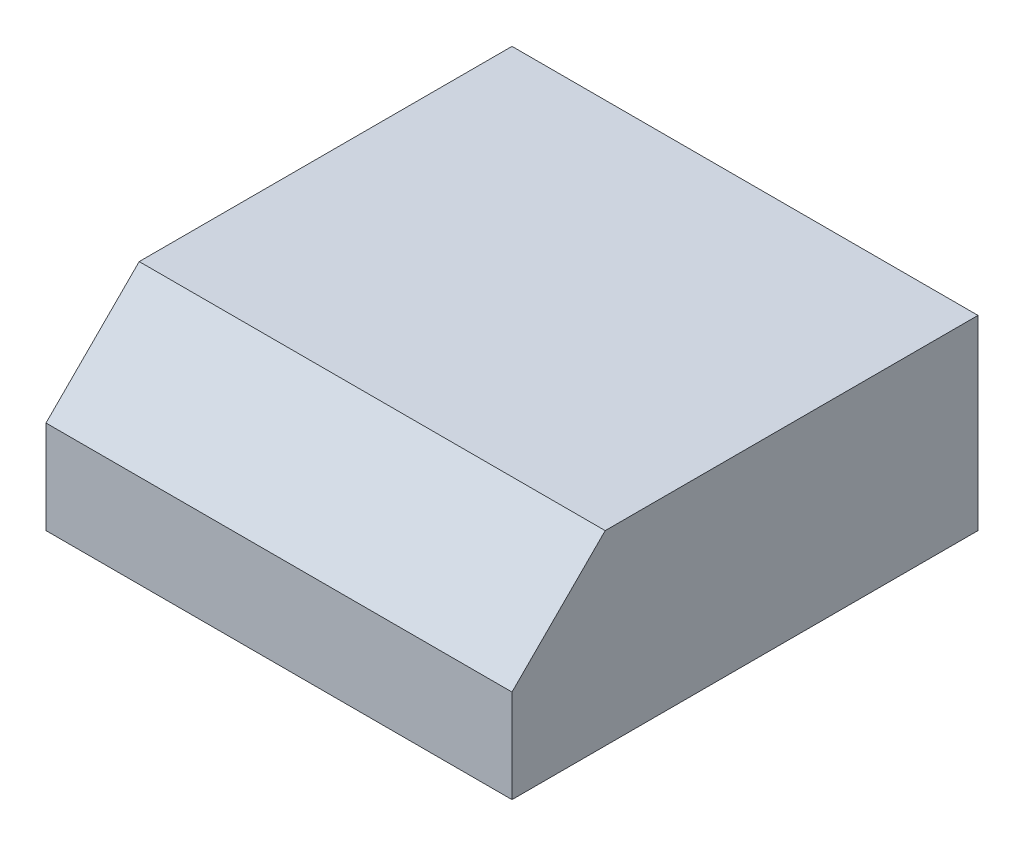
from build123d import *

# Parameters (mm, degrees)
SKETCH2_W      = 50
SKETCH2_H      = 50
EXTRUDE1_DEPTH = 20
SKETCH4_R      = 3.079857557
EXTRUDE3_DEPTH = 10
CHAMFER1_SIZE  = 10


with BuildPart() as part:
    # Sketch2 → Extrude1 (new body)
    with BuildSketch(Plane(origin=(0, 0, 0), x_dir=(1, 0, 0), z_dir=(0, 1, 0))):
        Rectangle(SKETCH2_W, SKETCH2_H)
    extrude(amount=EXTRUDE1_DEPTH)

    # Sketch4 → Extrude3 (add)
    with BuildSketch(Plane(origin=(0, 20, 0), x_dir=(-1, 0, 0), z_dir=(0, 1, 0))):
        with Locations(Location((-17.5, 18.719759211, 0), (0, 0, 90))):
            Circle(SKETCH4_R)
        with Locations(Location((0, 18.719759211, 0), (0, 0, 90))):
            Circle(SKETCH4_R)
        with Locations(Location((17.5, 18.719759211, 0), (0, 0, 90))):
            Circle(SKETCH4_R)
    extrude(amount=EXTRUDE3_DEPTH)

    # Chamfer1
    chamfer1_edges = [part.edges().sort_by_distance(p)[0] for p in [
        (0, 20, 25),
    ]]
    chamfer(chamfer1_edges, length=CHAMFER1_SIZE)


solid = part.part
